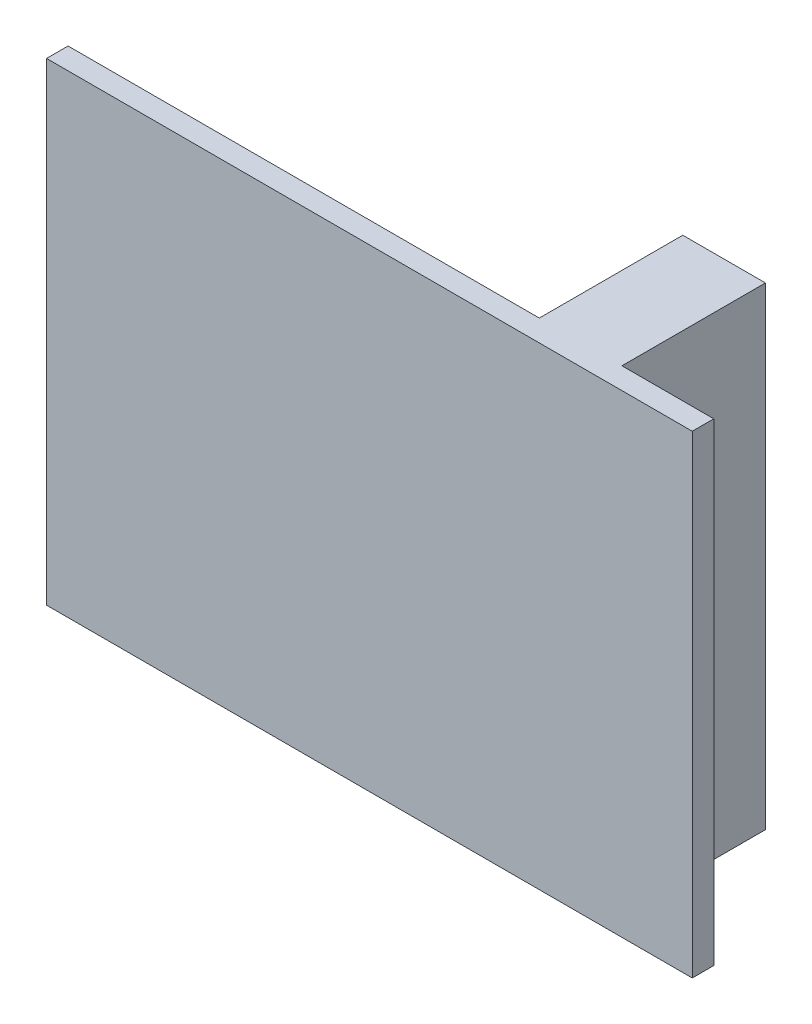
from build123d import *

# Parameters (mm, degrees)
ESQUISSE1_W        = 45
ESQUISSE1_H        = 33
BOSS_EXTRU_1_DEPTH = 1.5
ESQUISSE2_W        = 5.76
ESQUISSE2_H        = 33
BOSS_EXTRU_2_DEPTH = 10


with BuildPart() as part:
    # Esquisse1 → Boss.-Extru.1 (new body)
    with BuildSketch(Plane.XY):
        with Locations((-30.59806748, 12.78875969)):
            Rectangle(ESQUISSE1_W, ESQUISSE1_H)
    extrude(amount=BOSS_EXTRU_1_DEPTH)

    # Esquisse2 → Boss.-Extru.2 (add)
    with BuildSketch(Plane(origin=(0, 0, 0), x_dir=(-1, 0, 0), z_dir=(0, 0, -1))):
        with Locations((17.37806748, 12.78875969)):
            Rectangle(ESQUISSE2_W, ESQUISSE2_H)
    extrude(amount=BOSS_EXTRU_2_DEPTH)


solid = part.part
